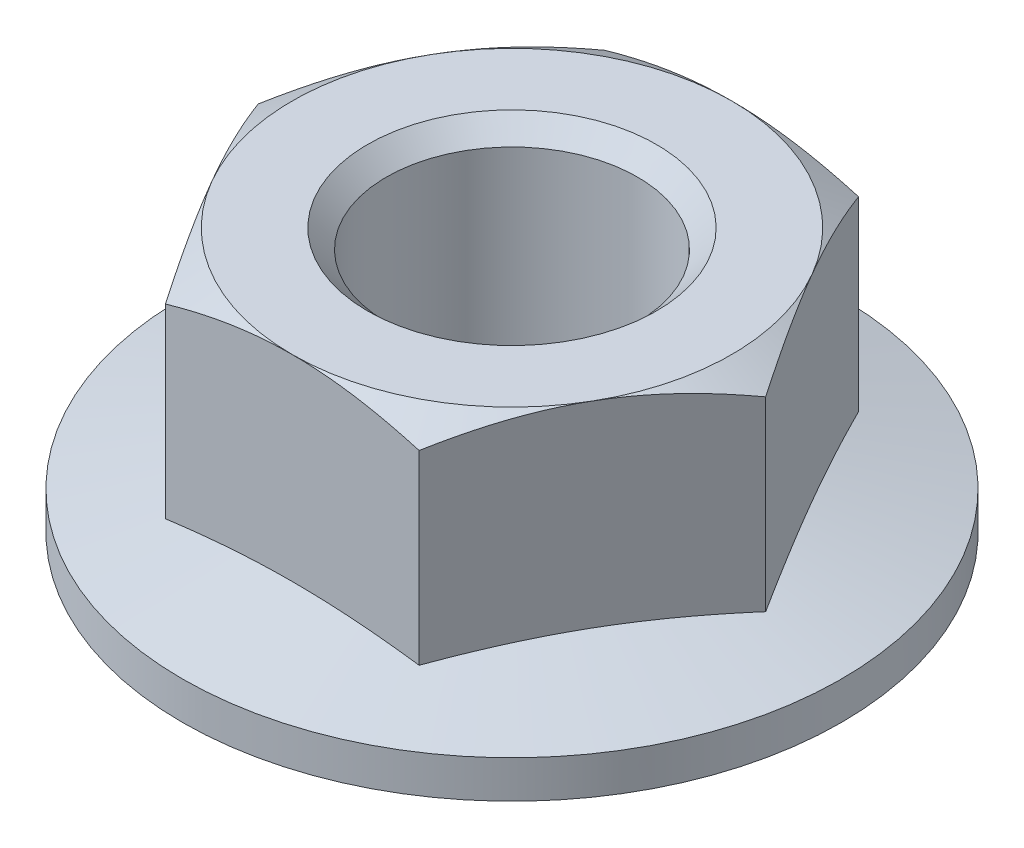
ISO-10303-21;
HEADER;
FILE_DESCRIPTION(('STEP AP214'),'2;1');
FILE_NAME('part.step','',(''),(''),'','','');
FILE_SCHEMA(('AUTOMOTIVE_DESIGN { 1 0 10303 214 1 1 1 1 }'));
ENDSEC;
DATA;
#1=APPLICATION_CONTEXT('core data for automotive mechanical design processes');
#2=APPLICATION_PROTOCOL_DEFINITION('international standard','automotive_design',2000,#1);
#3=PRODUCT_CONTEXT('',#1,'mechanical');
#4=PRODUCT('Part','Part','',(#3));
#5=PRODUCT_RELATED_PRODUCT_CATEGORY('part','',(#4));
#6=PRODUCT_DEFINITION_FORMATION('','',#4);
#7=PRODUCT_DEFINITION_CONTEXT('part definition',#1,'design');
#8=PRODUCT_DEFINITION('design','',#6,#7);
#9=PRODUCT_DEFINITION_SHAPE('','',#8);
#10=(LENGTH_UNIT() NAMED_UNIT(*) SI_UNIT(.MILLI.,.METRE.));
#11=(NAMED_UNIT(*) PLANE_ANGLE_UNIT() SI_UNIT($,.RADIAN.));
#12=(NAMED_UNIT(*) SI_UNIT($,.STERADIAN.) SOLID_ANGLE_UNIT());
#13=UNCERTAINTY_MEASURE_WITH_UNIT(LENGTH_MEASURE(1.E-05),#10,'distance_accuracy_value','');
#14=(GEOMETRIC_REPRESENTATION_CONTEXT(3) GLOBAL_UNCERTAINTY_ASSIGNED_CONTEXT((#13)) GLOBAL_UNIT_ASSIGNED_CONTEXT((#10,
#11,#12)) REPRESENTATION_CONTEXT('',''));
#15=CARTESIAN_POINT('',(0.,0.,0.));
#16=DIRECTION('',(0.,0.,1.));
#17=DIRECTION('',(1.,0.,0.));
#18=AXIS2_PLACEMENT_3D('',#15,#16,#17);
#19=CARTESIAN_POINT('',(1.1906925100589E-08,2.2208428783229,0.));
#20=DIRECTION('',(0.,-1.,0.));
#21=DIRECTION('',(0.,0.,-1.));
#22=AXIS2_PLACEMENT_3D('',#19,#20,#21);
#23=CONICAL_SURFACE('',#22,4.84974226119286,1.0471975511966);
#24=CARTESIAN_POINT('',(4.84988083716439,2.22076287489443,-0.000239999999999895));
#25=CARTESIAN_POINT('',(4.743320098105,2.28230880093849,0.18432861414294));
#26=CARTESIAN_POINT('',(4.6358395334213,2.33828260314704,0.370490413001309));
#27=CARTESIAN_POINT('',(4.41901725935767,2.43598549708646,0.746037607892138));
#28=CARTESIAN_POINT('',(4.30967169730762,2.477680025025,0.935429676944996));
#29=CARTESIAN_POINT('',(4.09233570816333,2.54258371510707,1.31186665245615));
#30=CARTESIAN_POINT('',(3.98437872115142,2.56622484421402,1.49885363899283));
#31=CARTESIAN_POINT('',(3.76795676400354,2.59444758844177,1.87370746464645));
#32=CARTESIAN_POINT('',(3.6594925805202,2.5990525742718,2.06157294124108));
#33=CARTESIAN_POINT('',(3.45682062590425,2.5894733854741,2.41261106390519));
#34=CARTESIAN_POINT('',(3.3625825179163,2.57764122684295,2.57583625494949));
#35=CARTESIAN_POINT('',(3.17472026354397,2.54013998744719,2.90122322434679));
#36=CARTESIAN_POINT('',(3.08109676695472,2.51445809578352,3.06338387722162));
#37=CARTESIAN_POINT('',(2.89284716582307,2.45025525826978,3.38944175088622));
#38=CARTESIAN_POINT('',(2.79824488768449,2.41146215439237,3.553297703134));
#39=CARTESIAN_POINT('',(2.61045131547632,2.32341702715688,3.8785657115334));
#40=CARTESIAN_POINT('',(2.51725761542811,2.27418569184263,4.03998193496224));
#41=CARTESIAN_POINT('',(2.42473257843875,2.22076287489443,4.20024));
#42=B_SPLINE_CURVE_WITH_KNOTS('',3,(#24,#25,#26,#27,#28,#29,#30,#31,#32,#33,#34,#35,#36,#37,#38,
#39,#40,#41),.UNSPECIFIED.,.F.,.F.,(4,2,2,2,2,2,2,2,4),(0.,0.665752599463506,1.33310548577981,
1.98394160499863,2.63397845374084,3.19998157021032,3.76650913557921,4.34560335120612,
4.92356038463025),.UNSPECIFIED.);
#43=CARTESIAN_POINT('',(4.84974227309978,2.2208428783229,0.));
#44=VERTEX_POINT('',#43);
#45=CARTESIAN_POINT('',(3.63730670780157,2.59597174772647,2.1));
#46=VERTEX_POINT('',#45);
#47=EDGE_CURVE('E304',#44,#46,#42,.T.);
#48=ORIENTED_EDGE('',*,*,#47,.F.);
#49=CARTESIAN_POINT('',(2.42473257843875,2.22076287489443,-4.20024));
#50=CARTESIAN_POINT('',(2.53129331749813,2.28230880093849,-4.01567138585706));
#51=CARTESIAN_POINT('',(2.63877388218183,2.33828260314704,-3.82950958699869));
#52=CARTESIAN_POINT('',(2.85559615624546,2.43598549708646,-3.45396239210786));
#53=CARTESIAN_POINT('',(2.96494171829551,2.477680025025,-3.264570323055));
#54=CARTESIAN_POINT('',(3.18227770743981,2.54258371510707,-2.88813334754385));
#55=CARTESIAN_POINT('',(3.29023469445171,2.56622484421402,-2.70114636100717));
#56=CARTESIAN_POINT('',(3.50665665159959,2.59444758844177,-2.32629253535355));
#57=CARTESIAN_POINT('',(3.61512083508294,2.5990525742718,-2.13842705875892));
#58=CARTESIAN_POINT('',(3.81779278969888,2.5894733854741,-1.78738893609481));
#59=CARTESIAN_POINT('',(3.91203089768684,2.57764122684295,-1.62416374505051));
#60=CARTESIAN_POINT('',(4.09989315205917,2.54013998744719,-1.29877677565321));
#61=CARTESIAN_POINT('',(4.19351664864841,2.51445809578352,-1.13661612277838));
#62=CARTESIAN_POINT('',(4.38176624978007,2.45025525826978,-0.810558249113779));
#63=CARTESIAN_POINT('',(4.47636852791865,2.41146215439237,-0.646702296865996));
#64=CARTESIAN_POINT('',(4.66416210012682,2.32341702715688,-0.321434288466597));
#65=CARTESIAN_POINT('',(4.75735580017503,2.27418569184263,-0.160018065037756));
#66=CARTESIAN_POINT('',(4.84988083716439,2.22076287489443,0.000240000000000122));
#67=B_SPLINE_CURVE_WITH_KNOTS('',3,(#49,#50,#51,#52,#53,#54,#55,#56,#57,#58,#59,#60,#61,#62,#63,
#64,#65,#66),.UNSPECIFIED.,.F.,.F.,(4,2,2,2,2,2,2,2,4),(0.,0.665752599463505,1.33310548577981,
1.98394160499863,2.63397845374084,3.19998157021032,3.76650913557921,4.34560335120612,
4.92356038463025),.UNSPECIFIED.);
#68=CARTESIAN_POINT('',(3.63730670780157,2.59597174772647,-2.1));
#69=VERTEX_POINT('',#68);
#70=EDGE_CURVE('E111',#69,#44,#67,.T.);
#71=ORIENTED_EDGE('',*,*,#70,.F.);
#72=CARTESIAN_POINT('',(1.1906925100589E-08,2.59597174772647,0.));
#73=DIRECTION('',(0.,1.,0.));
#74=DIRECTION('',(0.,0.,1.));
#75=AXIS2_PLACEMENT_3D('',#72,#73,#74);
#76=CIRCLE('',#75,4.2);
#77=EDGE_CURVE('E279',#46,#69,#76,.T.);
#78=ORIENTED_EDGE('',*,*,#77,.F.);
#79=EDGE_LOOP('',(#48,#71,#78));
#80=FACE_BOUND('',#79,.T.);
#81=ADVANCED_FACE('F40',(#80),#23,.T.);
#82=CARTESIAN_POINT('',(2.42487114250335,2.2208428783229,4.2));
#83=VERTEX_POINT('',#82);
#84=EDGE_CURVE('E225',#46,#83,#42,.T.);
#85=ORIENTED_EDGE('',*,*,#84,.F.);
#86=CARTESIAN_POINT('',(1.19069241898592E-08,2.59597174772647,4.2));
#87=VERTEX_POINT('',#86);
#88=EDGE_CURVE('E280',#87,#46,#76,.T.);
#89=ORIENTED_EDGE('',*,*,#88,.F.);
#90=CARTESIAN_POINT('',(7.28933992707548,0.163735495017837,4.2));
#91=CARTESIAN_POINT('',(7.11486696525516,0.251002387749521,4.2));
#92=CARTESIAN_POINT('',(6.94008948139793,0.337666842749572,4.2));
#93=CARTESIAN_POINT('',(6.58978667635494,0.509499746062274,4.2));
#94=CARTESIAN_POINT('',(6.41426130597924,0.59466809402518,4.2));
#95=CARTESIAN_POINT('',(6.06199245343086,0.763375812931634,4.2));
#96=CARTESIAN_POINT('',(5.88524722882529,0.846911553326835,4.2));
#97=CARTESIAN_POINT('',(5.53073100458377,1.01177234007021,4.2));
#98=CARTESIAN_POINT('',(5.35296002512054,1.09309742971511,4.2));
#99=CARTESIAN_POINT('',(4.98816803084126,1.25662493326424,4.2));
#100=CARTESIAN_POINT('',(4.80109071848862,1.33870217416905,4.2));
#101=CARTESIAN_POINT('',(4.4253413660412,1.49911775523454,4.2));
#102=CARTESIAN_POINT('',(4.23666938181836,1.57745622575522,4.2));
#103=CARTESIAN_POINT('',(3.85752408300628,1.72934602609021,4.2));
#104=CARTESIAN_POINT('',(3.66705188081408,1.8029001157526,4.2));
#105=CARTESIAN_POINT('',(3.28388177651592,1.9439338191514,4.2));
#106=CARTESIAN_POINT('',(3.09118412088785,2.01141409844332,4.2));
#107=CARTESIAN_POINT('',(2.65771925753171,2.15352486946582,4.2));
#108=CARTESIAN_POINT('',(2.41627512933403,2.22612196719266,4.2));
#109=CARTESIAN_POINT('',(1.92903367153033,2.3553529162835,4.2));
#110=CARTESIAN_POINT('',(1.68323673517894,2.41198820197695,4.2));
#111=CARTESIAN_POINT('',(1.31372733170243,2.4809882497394,4.2));
#112=CARTESIAN_POINT('',(1.19147091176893,2.50122237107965,4.2));
#113=CARTESIAN_POINT('',(0.946175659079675,2.53614748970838,4.2));
#114=CARTESIAN_POINT('',(0.823136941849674,2.55083928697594,4.2));
#115=CARTESIAN_POINT('',(0.57652320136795,2.57424030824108,4.2));
#116=CARTESIAN_POINT('',(0.452948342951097,2.58295125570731,4.2));
#117=CARTESIAN_POINT('',(0.205513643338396,2.59411488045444,4.2));
#118=CARTESIAN_POINT('',(0.0816538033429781,2.59656758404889,4.2));
#119=CARTESIAN_POINT('',(-0.166770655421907,2.59512695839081,4.2));
#120=CARTESIAN_POINT('',(-0.291335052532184,2.59119553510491,4.2));
#121=CARTESIAN_POINT('',(-0.540103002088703,2.57704895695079,4.2));
#122=CARTESIAN_POINT('',(-0.664306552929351,2.5668337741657,4.2));
#123=CARTESIAN_POINT('',(-0.912114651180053,2.54044543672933,4.2));
#124=CARTESIAN_POINT('',(-1.03571899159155,2.52427035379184,4.2));
#125=CARTESIAN_POINT('',(-1.28209244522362,2.48643637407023,4.2));
#126=CARTESIAN_POINT('',(-1.40486143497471,2.4647766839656,4.2));
#127=CARTESIAN_POINT('',(-1.77581159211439,2.39159054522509,4.2));
#128=CARTESIAN_POINT('',(-2.0224788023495,2.33233143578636,4.2));
#129=CARTESIAN_POINT('',(-2.51155018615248,2.19823166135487,4.2));
#130=CARTESIAN_POINT('',(-2.75395187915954,2.12338223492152,4.2));
#131=CARTESIAN_POINT('',(-3.18378906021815,1.97930803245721,4.2));
#132=CARTESIAN_POINT('',(-3.37196638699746,1.91226386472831,4.2));
#133=CARTESIAN_POINT('',(-3.74616762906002,1.77259269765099,4.2));
#134=CARTESIAN_POINT('',(-3.93219212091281,1.69996723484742,4.2));
#135=CARTESIAN_POINT('',(-4.30257983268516,1.55026630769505,4.2));
#136=CARTESIAN_POINT('',(-4.48694182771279,1.47318783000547,4.2));
#137=CARTESIAN_POINT('',(-4.85416725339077,1.31553716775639,4.2));
#138=CARTESIAN_POINT('',(-5.03703063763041,1.23496487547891,4.2));
#139=CARTESIAN_POINT('',(-5.39380024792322,1.07448943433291,4.2));
#140=CARTESIAN_POINT('',(-5.56775857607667,0.994701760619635,4.2));
#141=CARTESIAN_POINT('',(-5.91469657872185,0.833036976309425,4.2));
#142=CARTESIAN_POINT('',(-6.08767626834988,0.751159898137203,4.2));
#143=CARTESIAN_POINT('',(-6.43250489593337,0.585834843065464,4.2));
#144=CARTESIAN_POINT('',(-6.60435529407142,0.502389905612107,4.2));
#145=CARTESIAN_POINT('',(-6.94734786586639,0.334068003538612,4.2));
#146=CARTESIAN_POINT('',(-7.11849005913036,0.249191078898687,4.2));
#147=CARTESIAN_POINT('',(-7.28933990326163,0.163735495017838,4.2));
#148=B_SPLINE_CURVE_WITH_KNOTS('',3,(#90,#91,#92,#93,#94,#95,#96,#97,#98,#99,#100,#101,#102,
#103,#104,#105,#106,#107,#108,#109,#110,#111,#112,#113,#114,#115,#116,#117,#118,#119,#120,#121,
#122,#123,#124,#125,#126,#127,#128,#129,#130,#131,#132,#133,#134,#135,#136,#137,#138,#139,#140,
#141,#142,#143,#144,#145,#146,#147),.UNSPECIFIED.,.F.,.F.,(4,2,2,2,2,2,2,2,2,2,2,2,2,2,2,2,2,2,
2,2,2,2,2,2,2,2,2,2,4),(0.,0.58524400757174,1.1705271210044,1.75699027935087,2.34344194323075,
2.95628113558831,3.56909894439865,4.18156005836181,4.79395397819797,5.54993830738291,
6.30585468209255,6.67750740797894,7.04910646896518,7.4205984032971,7.79208877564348,
8.16580398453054,8.53952085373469,8.91335874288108,9.28725073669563,10.0475459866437,
10.8082696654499,11.4074579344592,12.0064818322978,12.6059159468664,13.2053685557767,
13.7795021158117,14.3536267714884,14.9267344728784,15.4998261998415),.UNSPECIFIED.);
#149=EDGE_CURVE('E224',#83,#87,#148,.T.);
#150=ORIENTED_EDGE('',*,*,#149,.F.);
#151=EDGE_LOOP('',(#85,#89,#150));
#152=FACE_BOUND('',#151,.T.);
#153=ADVANCED_FACE('F242',(#152),#23,.T.);
#154=CARTESIAN_POINT('',(-2.4248711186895,2.2208428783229,4.2));
#155=VERTEX_POINT('',#154);
#156=EDGE_CURVE('E218',#87,#155,#148,.T.);
#157=ORIENTED_EDGE('',*,*,#156,.F.);
#158=CARTESIAN_POINT('',(-3.63730668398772,2.59597174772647,2.1));
#159=VERTEX_POINT('',#158);
#160=EDGE_CURVE('E283',#159,#87,#76,.T.);
#161=ORIENTED_EDGE('',*,*,#160,.F.);
#162=CARTESIAN_POINT('',(-2.4247325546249,2.22076287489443,4.20024));
#163=CARTESIAN_POINT('',(-2.53129329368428,2.28230880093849,4.01567138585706));
#164=CARTESIAN_POINT('',(-2.63877385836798,2.33828260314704,3.82950958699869));
#165=CARTESIAN_POINT('',(-2.85559613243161,2.43598549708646,3.45396239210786));
#166=CARTESIAN_POINT('',(-2.96494169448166,2.477680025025,3.264570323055));
#167=CARTESIAN_POINT('',(-3.18227768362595,2.54258371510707,2.88813334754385));
#168=CARTESIAN_POINT('',(-3.29023467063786,2.56622484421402,2.70114636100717));
#169=CARTESIAN_POINT('',(-3.50665662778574,2.59444758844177,2.32629253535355));
#170=CARTESIAN_POINT('',(-3.61512081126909,2.5990525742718,2.13842705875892));
#171=CARTESIAN_POINT('',(-3.81779276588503,2.5894733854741,1.78738893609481));
#172=CARTESIAN_POINT('',(-3.91203087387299,2.57764122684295,1.62416374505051));
#173=CARTESIAN_POINT('',(-4.09989312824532,2.54013998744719,1.29877677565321));
#174=CARTESIAN_POINT('',(-4.19351662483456,2.51445809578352,1.13661612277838));
#175=CARTESIAN_POINT('',(-4.38176622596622,2.45025525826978,0.810558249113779));
#176=CARTESIAN_POINT('',(-4.4763685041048,2.41146215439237,0.646702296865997));
#177=CARTESIAN_POINT('',(-4.66416207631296,2.32341702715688,0.321434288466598));
#178=CARTESIAN_POINT('',(-4.75735577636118,2.27418569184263,0.160018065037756));
#179=CARTESIAN_POINT('',(-4.84988081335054,2.22076287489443,-0.000239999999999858));
#180=B_SPLINE_CURVE_WITH_KNOTS('',3,(#162,#163,#164,#165,#166,#167,#168,#169,#170,#171,#172,
#173,#174,#175,#176,#177,#178,#179),.UNSPECIFIED.,.F.,.F.,(4,2,2,2,2,2,2,2,4),(0.,
0.665752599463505,1.3331054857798,1.98394160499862,2.63397845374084,3.19998157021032,
3.76650913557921,4.34560335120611,4.92356038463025),.UNSPECIFIED.);
#181=EDGE_CURVE('E217',#155,#159,#180,.T.);
#182=ORIENTED_EDGE('',*,*,#181,.F.);
#183=EDGE_LOOP('',(#157,#161,#182));
#184=FACE_BOUND('',#183,.T.);
#185=ADVANCED_FACE('F248',(#184),#23,.T.);
#186=CARTESIAN_POINT('',(-4.84974224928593,2.2208428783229,0.));
#187=VERTEX_POINT('',#186);
#188=EDGE_CURVE('E211',#159,#187,#180,.T.);
#189=ORIENTED_EDGE('',*,*,#188,.F.);
#190=CARTESIAN_POINT('',(-3.63730668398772,2.59597174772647,-2.1));
#191=VERTEX_POINT('',#190);
#192=EDGE_CURVE('E275',#191,#159,#76,.T.);
#193=ORIENTED_EDGE('',*,*,#192,.F.);
#194=CARTESIAN_POINT('',(-4.84988081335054,2.22076287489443,0.000240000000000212));
#195=CARTESIAN_POINT('',(-4.74332007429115,2.28230880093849,-0.18432861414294));
#196=CARTESIAN_POINT('',(-4.63583950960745,2.33828260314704,-0.370490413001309));
#197=CARTESIAN_POINT('',(-4.41901723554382,2.43598549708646,-0.746037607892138));
#198=CARTESIAN_POINT('',(-4.30967167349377,2.477680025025,-0.935429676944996));
#199=CARTESIAN_POINT('',(-4.09233568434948,2.54258371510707,-1.31186665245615));
#200=CARTESIAN_POINT('',(-3.98437869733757,2.56622484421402,-1.49885363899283));
#201=CARTESIAN_POINT('',(-3.76795674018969,2.59444758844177,-1.87370746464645));
#202=CARTESIAN_POINT('',(-3.65949255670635,2.5990525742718,-2.06157294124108));
#203=CARTESIAN_POINT('',(-3.4568206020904,2.5894733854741,-2.41261106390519));
#204=CARTESIAN_POINT('',(-3.36258249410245,2.57764122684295,-2.57583625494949));
#205=CARTESIAN_POINT('',(-3.17472023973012,2.54013998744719,-2.9012232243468));
#206=CARTESIAN_POINT('',(-3.08109674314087,2.51445809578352,-3.06338387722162));
#207=CARTESIAN_POINT('',(-2.89284714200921,2.45025525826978,-3.38944175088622));
#208=CARTESIAN_POINT('',(-2.79824486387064,2.41146215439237,-3.553297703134));
#209=CARTESIAN_POINT('',(-2.61045129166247,2.32341702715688,-3.8785657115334));
#210=CARTESIAN_POINT('',(-2.51725759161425,2.27418569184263,-4.03998193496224));
#211=CARTESIAN_POINT('',(-2.4247325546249,2.22076287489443,-4.20024));
#212=B_SPLINE_CURVE_WITH_KNOTS('',3,(#194,#195,#196,#197,#198,#199,#200,#201,#202,#203,#204,
#205,#206,#207,#208,#209,#210,#211),.UNSPECIFIED.,.F.,.F.,(4,2,2,2,2,2,2,2,4),(0.,
0.665752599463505,1.33310548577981,1.98394160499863,2.63397845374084,3.19998157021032,
3.76650913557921,4.34560335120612,4.92356038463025),.UNSPECIFIED.);
#213=EDGE_CURVE('E203',#187,#191,#212,.T.);
#214=ORIENTED_EDGE('',*,*,#213,.F.);
#215=EDGE_LOOP('',(#189,#193,#214));
#216=FACE_BOUND('',#215,.T.);
#217=ADVANCED_FACE('F259',(#216),#23,.T.);
#218=CARTESIAN_POINT('',(-2.4248711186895,2.2208428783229,-4.2));
#219=VERTEX_POINT('',#218);
#220=EDGE_CURVE('E196',#191,#219,#212,.T.);
#221=ORIENTED_EDGE('',*,*,#220,.F.);
#222=CARTESIAN_POINT('',(1.19069252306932E-08,2.59597174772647,-4.2));
#223=VERTEX_POINT('',#222);
#224=EDGE_CURVE('E271',#223,#191,#76,.T.);
#225=ORIENTED_EDGE('',*,*,#224,.F.);
#226=CARTESIAN_POINT('',(-7.28933990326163,0.163735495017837,-4.2));
#227=CARTESIAN_POINT('',(-7.11486694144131,0.25100238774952,-4.2));
#228=CARTESIAN_POINT('',(-6.94008945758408,0.337666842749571,-4.2));
#229=CARTESIAN_POINT('',(-6.58978665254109,0.509499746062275,-4.2));
#230=CARTESIAN_POINT('',(-6.41426128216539,0.594668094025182,-4.2));
#231=CARTESIAN_POINT('',(-6.06199242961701,0.763375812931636,-4.2));
#232=CARTESIAN_POINT('',(-5.88524720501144,0.846911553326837,-4.2));
#233=CARTESIAN_POINT('',(-5.53073098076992,1.01177234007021,-4.2));
#234=CARTESIAN_POINT('',(-5.35296000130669,1.09309742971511,-4.2));
#235=CARTESIAN_POINT('',(-4.98816800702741,1.25662493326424,-4.2));
#236=CARTESIAN_POINT('',(-4.80109069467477,1.33870217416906,-4.2));
#237=CARTESIAN_POINT('',(-4.42534134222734,1.49911775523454,-4.2));
#238=CARTESIAN_POINT('',(-4.23666935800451,1.57745622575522,-4.2));
#239=CARTESIAN_POINT('',(-3.85752405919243,1.72934602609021,-4.2));
#240=CARTESIAN_POINT('',(-3.66705185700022,1.8029001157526,-4.2));
#241=CARTESIAN_POINT('',(-3.28388175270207,1.9439338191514,-4.2));
#242=CARTESIAN_POINT('',(-3.091184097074,2.01141409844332,-4.2));
#243=CARTESIAN_POINT('',(-2.65771923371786,2.15352486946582,-4.2));
#244=CARTESIAN_POINT('',(-2.41627510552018,2.22612196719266,-4.2));
#245=CARTESIAN_POINT('',(-1.92903364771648,2.35535291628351,-4.2));
#246=CARTESIAN_POINT('',(-1.68323671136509,2.41198820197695,-4.2));
#247=CARTESIAN_POINT('',(-1.31372730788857,2.4809882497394,-4.2));
#248=CARTESIAN_POINT('',(-1.19147088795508,2.50122237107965,-4.2));
#249=CARTESIAN_POINT('',(-0.946175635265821,2.53614748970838,-4.2));
#250=CARTESIAN_POINT('',(-0.82313691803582,2.55083928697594,-4.2));
#251=CARTESIAN_POINT('',(-0.576523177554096,2.57424030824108,-4.2));
#252=CARTESIAN_POINT('',(-0.452948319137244,2.58295125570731,-4.2));
#253=CARTESIAN_POINT('',(-0.205513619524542,2.59411488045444,-4.2));
#254=CARTESIAN_POINT('',(-0.0816537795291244,2.59656758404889,-4.2));
#255=CARTESIAN_POINT('',(0.166770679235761,2.59512695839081,-4.2));
#256=CARTESIAN_POINT('',(0.291335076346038,2.59119553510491,-4.2));
#257=CARTESIAN_POINT('',(0.540103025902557,2.57704895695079,-4.2));
#258=CARTESIAN_POINT('',(0.664306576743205,2.5668337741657,-4.2));
#259=CARTESIAN_POINT('',(0.912114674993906,2.54044543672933,-4.2));
#260=CARTESIAN_POINT('',(1.0357190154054,2.52427035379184,-4.2));
#261=CARTESIAN_POINT('',(1.28209246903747,2.48643637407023,-4.2));
#262=CARTESIAN_POINT('',(1.40486145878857,2.4647766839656,-4.2));
#263=CARTESIAN_POINT('',(1.77581161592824,2.39159054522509,-4.2));
#264=CARTESIAN_POINT('',(2.02247882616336,2.33233143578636,-4.2));
#265=CARTESIAN_POINT('',(2.51155020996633,2.19823166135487,-4.2));
#266=CARTESIAN_POINT('',(2.7539519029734,2.12338223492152,-4.2));
#267=CARTESIAN_POINT('',(3.18378908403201,1.97930803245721,-4.2));
#268=CARTESIAN_POINT('',(3.37196641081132,1.91226386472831,-4.2));
#269=CARTESIAN_POINT('',(3.74616765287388,1.77259269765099,-4.2));
#270=CARTESIAN_POINT('',(3.93219214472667,1.69996723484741,-4.2));
#271=CARTESIAN_POINT('',(4.30257985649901,1.55026630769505,-4.2));
#272=CARTESIAN_POINT('',(4.48694185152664,1.47318783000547,-4.2));
#273=CARTESIAN_POINT('',(4.85416727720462,1.31553716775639,-4.2));
#274=CARTESIAN_POINT('',(5.03703066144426,1.23496487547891,-4.2));
#275=CARTESIAN_POINT('',(5.39380027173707,1.07448943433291,-4.2));
#276=CARTESIAN_POINT('',(5.56775859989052,0.994701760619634,-4.2));
#277=CARTESIAN_POINT('',(5.9146966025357,0.833036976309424,-4.2));
#278=CARTESIAN_POINT('',(6.08767629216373,0.751159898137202,-4.2));
#279=CARTESIAN_POINT('',(6.43250491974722,0.585834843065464,-4.2));
#280=CARTESIAN_POINT('',(6.60435531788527,0.502389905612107,-4.2));
#281=CARTESIAN_POINT('',(6.94734788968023,0.334068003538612,-4.2));
#282=CARTESIAN_POINT('',(7.11849008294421,0.249191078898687,-4.2));
#283=CARTESIAN_POINT('',(7.28933992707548,0.163735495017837,-4.2));
#284=B_SPLINE_CURVE_WITH_KNOTS('',3,(#226,#227,#228,#229,#230,#231,#232,#233,#234,#235,#236,
#237,#238,#239,#240,#241,#242,#243,#244,#245,#246,#247,#248,#249,#250,#251,#252,#253,#254,#255,
#256,#257,#258,#259,#260,#261,#262,#263,#264,#265,#266,#267,#268,#269,#270,#271,#272,#273,#274,
#275,#276,#277,#278,#279,#280,#281,#282,#283),.UNSPECIFIED.,.F.,.F.,(4,2,2,2,2,2,2,2,2,2,2,2,2,
2,2,2,2,2,2,2,2,2,2,2,2,2,2,2,4),(0.,0.585244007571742,1.1705271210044,1.75699027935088,
2.34344194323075,2.95628113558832,3.56909894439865,4.18156005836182,4.79395397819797,
5.54993830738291,6.30585468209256,6.67750740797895,7.04910646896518,7.4205984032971,
7.79208877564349,8.16580398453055,8.5395208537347,8.91335874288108,9.28725073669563,
10.0475459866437,10.8082696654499,11.4074579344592,12.0064818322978,12.6059159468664,
13.2053685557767,13.7795021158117,14.3536267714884,14.9267344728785,15.4998261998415),.UNSPECIFIED.);
#285=EDGE_CURVE('E204',#219,#223,#284,.T.);
#286=ORIENTED_EDGE('',*,*,#285,.F.);
#287=EDGE_LOOP('',(#221,#225,#286));
#288=FACE_BOUND('',#287,.T.);
#289=ADVANCED_FACE('F251',(#288),#23,.T.);
#290=CARTESIAN_POINT('',(2.42487114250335,2.2208428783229,-4.2));
#291=VERTEX_POINT('',#290);
#292=EDGE_CURVE('E205',#223,#291,#284,.T.);
#293=ORIENTED_EDGE('',*,*,#292,.F.);
#294=EDGE_CURVE('E265',#69,#223,#76,.T.);
#295=ORIENTED_EDGE('',*,*,#294,.F.);
#296=EDGE_CURVE('E61',#291,#69,#67,.T.);
#297=ORIENTED_EDGE('',*,*,#296,.F.);
#298=EDGE_LOOP('',(#293,#295,#297));
#299=FACE_BOUND('',#298,.T.);
#300=ADVANCED_FACE('F244',(#299),#23,.T.);
#301=CARTESIAN_POINT('',(1.1906925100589E-08,2.59597174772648,0.));
#302=DIRECTION('',(0.,1.,0.));
#303=DIRECTION('',(0.,0.,1.));
#304=AXIS2_PLACEMENT_3D('',#301,#302,#303);
#305=CONICAL_SURFACE('',#304,2.76,0.785398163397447);
#306=CARTESIAN_POINT('',(1.1906925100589E-08,2.23597174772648,0.));
#307=DIRECTION('',(0.,1.,0.));
#308=DIRECTION('',(0.,0.,1.));
#309=AXIS2_PLACEMENT_3D('',#306,#307,#308);
#310=CIRCLE('',#309,2.4);
#311=CARTESIAN_POINT('',(1.1906925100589E-08,2.23597174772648,2.4));
#312=VERTEX_POINT('',#311);
#313=EDGE_CURVE('E11',#312,#312,#310,.T.);
#314=ORIENTED_EDGE('',*,*,#313,.F.);
#315=EDGE_LOOP('',(#314));
#316=FACE_BOUND('',#315,.T.);
#317=CARTESIAN_POINT('',(1.1906925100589E-08,2.59597174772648,0.));
#318=DIRECTION('',(0.,1.,0.));
#319=DIRECTION('',(0.,0.,1.));
#320=AXIS2_PLACEMENT_3D('',#317,#318,#319);
#321=CIRCLE('',#320,2.76);
#322=CARTESIAN_POINT('',(1.1906925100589E-08,2.59597174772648,2.76));
#323=VERTEX_POINT('',#322);
#324=EDGE_CURVE('E284',#323,#323,#321,.T.);
#325=ORIENTED_EDGE('',*,*,#324,.T.);
#326=EDGE_LOOP('',(#325));
#327=FACE_BOUND('',#326,.T.);
#328=ADVANCED_FACE('F42',(#316,#327),#305,.F.);
#329=CARTESIAN_POINT('',(1.1906925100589E-08,1.75597174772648,0.));
#330=DIRECTION('',(0.,1.,0.));
#331=DIRECTION('',(0.,0.,1.));
#332=AXIS2_PLACEMENT_3D('',#329,#330,#331);
#333=CYLINDRICAL_SURFACE('',#332,2.4);
#334=CARTESIAN_POINT('',(1.1906925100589E-08,-2.08402825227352,0.));
#335=DIRECTION('',(0.,1.,0.));
#336=DIRECTION('',(0.,0.,1.));
#337=AXIS2_PLACEMENT_3D('',#334,#335,#336);
#338=CIRCLE('',#337,2.4);
#339=CARTESIAN_POINT('',(1.1906925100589E-08,-2.08402825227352,2.4));
#340=VERTEX_POINT('',#339);
#341=EDGE_CURVE('E48',#340,#340,#338,.T.);
#342=ORIENTED_EDGE('',*,*,#341,.F.);
#343=EDGE_LOOP('',(#342));
#344=FACE_BOUND('',#343,.T.);
#345=ORIENTED_EDGE('',*,*,#313,.T.);
#346=EDGE_LOOP('',(#345));
#347=FACE_BOUND('',#346,.T.);
#348=ADVANCED_FACE('F257',(#344,#347),#333,.F.);
#349=CARTESIAN_POINT('',(1.1906925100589E-08,-2.08402825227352,0.));
#350=DIRECTION('',(0.,-1.,0.));
#351=DIRECTION('',(0.,0.,-1.));
#352=AXIS2_PLACEMENT_3D('',#349,#350,#351);
#353=CONICAL_SURFACE('',#352,2.4,0.785398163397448);
#354=CARTESIAN_POINT('',(1.1906925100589E-08,-2.44402825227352,0.));
#355=DIRECTION('',(0.,1.,0.));
#356=DIRECTION('',(0.,0.,1.));
#357=AXIS2_PLACEMENT_3D('',#354,#355,#356);
#358=CIRCLE('',#357,2.76);
#359=CARTESIAN_POINT('',(1.1906925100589E-08,-2.44402825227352,2.76));
#360=VERTEX_POINT('',#359);
#361=EDGE_CURVE('E290',#360,#360,#358,.T.);
#362=ORIENTED_EDGE('',*,*,#361,.F.);
#363=EDGE_LOOP('',(#362));
#364=FACE_BOUND('',#363,.T.);
#365=ORIENTED_EDGE('',*,*,#341,.T.);
#366=EDGE_LOOP('',(#365));
#367=FACE_BOUND('',#366,.T.);
#368=ADVANCED_FACE('F295',(#364,#367),#353,.F.);
#369=CARTESIAN_POINT('',(2.76000001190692,-2.44402825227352,0.));
#370=DIRECTION('',(0.,1.,0.));
#371=DIRECTION('',(0.,0.,1.));
#372=AXIS2_PLACEMENT_3D('',#369,#370,#371);
#373=PLANE('',#372);
#374=CARTESIAN_POINT('',(1.1906925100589E-08,-2.44402825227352,0.));
#375=DIRECTION('',(0.,1.,0.));
#376=DIRECTION('',(0.,0.,1.));
#377=AXIS2_PLACEMENT_3D('',#374,#375,#376);
#378=CIRCLE('',#377,6.3);
#379=CARTESIAN_POINT('',(1.1906925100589E-08,-2.44402825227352,6.3));
#380=VERTEX_POINT('',#379);
#381=EDGE_CURVE('E287',#380,#380,#378,.T.);
#382=ORIENTED_EDGE('',*,*,#381,.F.);
#383=EDGE_LOOP('',(#382));
#384=FACE_BOUND('',#383,.T.);
#385=ORIENTED_EDGE('',*,*,#361,.T.);
#386=EDGE_LOOP('',(#385));
#387=FACE_BOUND('',#386,.T.);
#388=ADVANCED_FACE('F398',(#384,#387),#373,.F.);
#389=CARTESIAN_POINT('',(1.1906925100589E-08,1.75597174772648,0.));
#390=DIRECTION('',(0.,1.,0.));
#391=DIRECTION('',(0.,0.,1.));
#392=AXIS2_PLACEMENT_3D('',#389,#390,#391);
#393=CYLINDRICAL_SURFACE('',#392,6.3);
#394=CARTESIAN_POINT('',(1.1906925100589E-08,-1.72402825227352,0.));
#395=DIRECTION('',(0.,1.,0.));
#396=DIRECTION('',(0.,0.,1.));
#397=AXIS2_PLACEMENT_3D('',#394,#395,#396);
#398=CIRCLE('',#397,6.3);
#399=CARTESIAN_POINT('',(1.1906925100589E-08,-1.72402825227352,6.3));
#400=VERTEX_POINT('',#399);
#401=EDGE_CURVE('E282',#400,#400,#398,.T.);
#402=ORIENTED_EDGE('',*,*,#401,.F.);
#403=EDGE_LOOP('',(#402));
#404=FACE_BOUND('',#403,.T.);
#405=ORIENTED_EDGE('',*,*,#381,.T.);
#406=EDGE_LOOP('',(#405));
#407=FACE_BOUND('',#406,.T.);
#408=ADVANCED_FACE('F152',(#404,#407),#393,.T.);
#409=CARTESIAN_POINT('',(1.1906925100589E-08,-1.72402825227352,0.));
#410=DIRECTION('',(0.,-1.,0.));
#411=DIRECTION('',(0.,0.,-1.));
#412=AXIS2_PLACEMENT_3D('',#409,#410,#411);
#413=CONICAL_SURFACE('',#412,6.3,1.30899693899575);
#414=CARTESIAN_POINT('',(-6.33555454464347,-2.07270154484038,-4.2));
#415=CARTESIAN_POINT('',(-6.14578611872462,-2.03033180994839,-4.2));
#416=CARTESIAN_POINT('',(-5.95589679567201,-1.98849399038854,-4.2));
#417=CARTESIAN_POINT('',(-5.57581690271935,-1.90616932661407,-4.2));
#418=CARTESIAN_POINT('',(-5.38562631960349,-1.86568254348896,-4.2));
#419=CARTESIAN_POINT('',(-5.00470834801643,-1.78631071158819,-4.2));
#420=CARTESIAN_POINT('',(-4.81398061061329,-1.74742733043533,-4.2));
#421=CARTESIAN_POINT('',(-4.4321226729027,-1.67169454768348,-4.2));
#422=CARTESIAN_POINT('',(-4.24099247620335,-1.63484512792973,-4.2));
#423=CARTESIAN_POINT('',(-3.86003557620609,-1.56399284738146,-4.2));
#424=CARTESIAN_POINT('',(-3.67021324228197,-1.52996673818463,-4.2));
#425=CARTESIAN_POINT('',(-3.29004670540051,-1.46497463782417,-4.2));
#426=CARTESIAN_POINT('',(-3.09970249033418,-1.43400871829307,-4.2));
#427=CARTESIAN_POINT('',(-2.5278395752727,-1.34675363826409,-4.2));
#428=CARTESIAN_POINT('',(-2.14540276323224,-1.29609018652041,-4.2));
#429=CARTESIAN_POINT('',(-1.56786545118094,-1.23623894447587,-4.2));
#430=CARTESIAN_POINT('',(-1.37360351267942,-1.21892833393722,-4.2));
#431=CARTESIAN_POINT('',(-0.984605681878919,-1.19075634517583,-4.2));
#432=CARTESIAN_POINT('',(-0.789869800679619,-1.1798948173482,-4.2));
#433=CARTESIAN_POINT('',(-0.40021678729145,-1.16525201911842,-4.2));
#434=CARTESIAN_POINT('',(-0.205299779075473,-1.16146750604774,-4.2));
#435=CARTESIAN_POINT('',(0.184539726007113,-1.16120926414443,-4.2));
#436=CARTESIAN_POINT('',(0.379462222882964,-1.16473554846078,-4.2));
#437=CARTESIAN_POINT('',(0.769942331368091,-1.17890779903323,-4.2));
#438=CARTESIAN_POINT('',(0.965498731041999,-1.18958649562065,-4.2));
#439=CARTESIAN_POINT('',(1.35614788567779,-1.21746922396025,-4.2));
#440=CARTESIAN_POINT('',(1.55124061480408,-1.23467361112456,-4.2));
#441=CARTESIAN_POINT('',(1.94096363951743,-1.27475806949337,-4.2));
#442=CARTESIAN_POINT('',(2.13559354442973,-1.2976418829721,-4.2));
#443=CARTESIAN_POINT('',(2.52422788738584,-1.34815660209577,-4.2));
#444=CARTESIAN_POINT('',(2.71823232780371,-1.37578748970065,-4.2));
#445=CARTESIAN_POINT('',(3.14008964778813,-1.44019050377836,-4.2));
#446=CARTESIAN_POINT('',(3.36782690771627,-1.47771443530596,-4.2));
#447=CARTESIAN_POINT('',(3.82257432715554,-1.55695245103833,-4.2));
#448=CARTESIAN_POINT('',(4.049584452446,-1.59866672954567,-4.2));
#449=CARTESIAN_POINT('',(4.50301948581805,-1.6853477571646,-4.2));
#450=CARTESIAN_POINT('',(4.72944428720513,-1.73031506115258,-4.2));
#451=CARTESIAN_POINT('',(5.18177807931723,-1.82278025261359,-4.2));
#452=CARTESIAN_POINT('',(5.40768706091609,-1.87027818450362,-4.2));
#453=CARTESIAN_POINT('',(6.08497149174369,-2.01575473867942,-4.2));
#454=CARTESIAN_POINT('',(6.53571293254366,-2.11667845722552,-4.2));
#455=CARTESIAN_POINT('',(7.43606429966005,-2.32345214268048,-4.2));
#456=CARTESIAN_POINT('',(7.88567419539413,-2.42930224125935,-4.2));
#457=CARTESIAN_POINT('',(8.55600802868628,-2.58970947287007,-4.2));
#458=CARTESIAN_POINT('',(8.7770311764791,-2.64302048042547,-4.2));
#459=CARTESIAN_POINT('',(9.21891260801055,-2.75030932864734,-4.2));
#460=CARTESIAN_POINT('',(9.43977089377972,-2.80428716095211,-4.2));
#461=CARTESIAN_POINT('',(10.1021585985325,-2.96705428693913,-4.2));
#462=CARTESIAN_POINT('',(10.5434841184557,-3.07667318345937,-4.2));
#463=CARTESIAN_POINT('',(11.4249849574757,-3.29729299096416,-4.2));
#464=CARTESIAN_POINT('',(11.8651609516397,-3.40829121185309,-4.2));
#465=CARTESIAN_POINT('',(12.7451932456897,-3.63146712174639,-4.2));
#466=CARTESIAN_POINT('',(13.1850495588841,-3.74364475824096,-4.2));
#467=CARTESIAN_POINT('',(13.6248021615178,-3.85622387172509,-4.2));
#468=B_SPLINE_CURVE_WITH_KNOTS('',3,(#414,#415,#416,#417,#418,#419,#420,#421,#422,#423,#424,
#425,#426,#427,#428,#429,#430,#431,#432,#433,#434,#435,#436,#437,#438,#439,#440,#441,#442,#443,
#444,#445,#446,#447,#448,#449,#450,#451,#452,#453,#454,#455,#456,#457,#458,#459,#460,#461,#462,
#463,#464,#465,#466,#467),.UNSPECIFIED.,.F.,.F.,(4,2,2,2,2,2,2,2,2,2,2,2,2,2,2,2,2,2,2,2,2,2,2,
2,2,2,4),(0.,0.583324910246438,1.16667616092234,1.75061956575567,2.33455775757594,
2.91307545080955,3.49160668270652,4.64840086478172,5.23340889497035,5.81840335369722,
6.40312970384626,6.98785710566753,7.57527874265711,8.16273237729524,8.75057412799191,
9.3384136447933,10.0307850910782,10.7231886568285,11.4157106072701,12.1082447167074,
13.4938983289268,14.8795889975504,15.5616728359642,16.2437481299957,17.6079503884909,
18.9698149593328,20.331619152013),.UNSPECIFIED.);
#469=CARTESIAN_POINT('',(2.42487114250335,-1.33543286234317,-4.2));
#470=VERTEX_POINT('',#469);
#471=CARTESIAN_POINT('',(-2.4248711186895,-1.33543286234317,-4.2));
#472=VERTEX_POINT('',#471);
#473=EDGE_CURVE('E124',#470,#472,#468,.F.);
#474=ORIENTED_EDGE('',*,*,#473,.F.);
#475=CARTESIAN_POINT('',(4.84988083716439,-1.33546999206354,0.000240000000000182));
#476=CARTESIAN_POINT('',(4.74917055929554,-1.30847223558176,-0.174195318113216));
#477=CARTESIAN_POINT('',(4.64827767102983,-1.28396264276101,-0.348946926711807));
#478=CARTESIAN_POINT('',(4.4461355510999,-1.2409014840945,-0.699067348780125));
#479=CARTESIAN_POINT('',(4.34488619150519,-1.22235233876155,-0.874436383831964));
#480=CARTESIAN_POINT('',(4.14264506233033,-1.19229505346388,-1.22472829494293));
#481=CARTESIAN_POINT('',(4.04165466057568,-1.1807510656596,-1.39964880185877));
#482=CARTESIAN_POINT('',(3.83954505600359,-1.16527174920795,-1.74971290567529));
#483=CARTESIAN_POINT('',(3.73842588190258,-1.16133494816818,-1.92485645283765));
#484=CARTESIAN_POINT('',(3.53618753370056,-1.16133494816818,-2.27514354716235));
#485=CARTESIAN_POINT('',(3.43506835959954,-1.16527174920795,-2.45028709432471));
#486=CARTESIAN_POINT('',(3.23295875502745,-1.1807510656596,-2.80035119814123));
#487=CARTESIAN_POINT('',(3.13196835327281,-1.19229505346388,-2.97527170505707));
#488=CARTESIAN_POINT('',(2.92972722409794,-1.22235233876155,-3.32556361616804));
#489=CARTESIAN_POINT('',(2.82847786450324,-1.2409014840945,-3.50093265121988));
#490=CARTESIAN_POINT('',(2.62633574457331,-1.28396264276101,-3.85105307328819));
#491=CARTESIAN_POINT('',(2.52544285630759,-1.30847223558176,-4.02580468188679));
#492=CARTESIAN_POINT('',(2.42473257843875,-1.33546999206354,-4.20024));
#493=B_SPLINE_CURVE_WITH_KNOTS('',3,(#475,#476,#477,#478,#479,#480,#481,#482,#483,#484,#485,
#486,#487,#488,#489,#490,#491,#492),.UNSPECIFIED.,.F.,.F.,(4,2,2,2,2,2,2,2,4),(0.,
0.6096974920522,1.21964226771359,1.82643882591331,2.4331179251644,3.0397970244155,
3.64659358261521,4.25653835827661,4.86623585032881),.UNSPECIFIED.);
#494=CARTESIAN_POINT('',(4.84974227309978,-1.33543286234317,0.));
#495=VERTEX_POINT('',#494);
#496=EDGE_CURVE('E55',#495,#470,#493,.T.);
#497=ORIENTED_EDGE('',*,*,#496,.F.);
#498=CARTESIAN_POINT('',(2.42473257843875,-1.33546999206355,4.20024));
#499=CARTESIAN_POINT('',(2.52544285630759,-1.30847223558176,4.02580468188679));
#500=CARTESIAN_POINT('',(2.62633574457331,-1.28396264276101,3.85105307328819));
#501=CARTESIAN_POINT('',(2.82847786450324,-1.2409014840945,3.50093265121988));
#502=CARTESIAN_POINT('',(2.92972722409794,-1.22235233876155,3.32556361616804));
#503=CARTESIAN_POINT('',(3.13196835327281,-1.19229505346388,2.97527170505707));
#504=CARTESIAN_POINT('',(3.23295875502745,-1.1807510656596,2.80035119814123));
#505=CARTESIAN_POINT('',(3.43506835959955,-1.16527174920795,2.45028709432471));
#506=CARTESIAN_POINT('',(3.53618753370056,-1.16133494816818,2.27514354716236));
#507=CARTESIAN_POINT('',(3.73842588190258,-1.16133494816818,1.92485645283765));
#508=CARTESIAN_POINT('',(3.83954505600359,-1.16527174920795,1.74971290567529));
#509=CARTESIAN_POINT('',(4.04165466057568,-1.1807510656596,1.39964880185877));
#510=CARTESIAN_POINT('',(4.14264506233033,-1.19229505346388,1.22472829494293));
#511=CARTESIAN_POINT('',(4.34488619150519,-1.22235233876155,0.874436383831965));
#512=CARTESIAN_POINT('',(4.4461355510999,-1.2409014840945,0.699067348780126));
#513=CARTESIAN_POINT('',(4.64827767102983,-1.28396264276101,0.348946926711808));
#514=CARTESIAN_POINT('',(4.74917055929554,-1.30847223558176,0.174195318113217));
#515=CARTESIAN_POINT('',(4.84988083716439,-1.33546999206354,-0.000239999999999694));
#516=B_SPLINE_CURVE_WITH_KNOTS('',3,(#498,#499,#500,#501,#502,#503,#504,#505,#506,#507,#508,
#509,#510,#511,#512,#513,#514,#515),.UNSPECIFIED.,.F.,.F.,(4,2,2,2,2,2,2,2,4),(0.,
0.609697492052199,1.21964226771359,1.82643882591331,2.4331179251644,3.0397970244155,
3.64659358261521,4.25653835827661,4.86623585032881),.UNSPECIFIED.);
#517=CARTESIAN_POINT('',(2.42487114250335,-1.33543286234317,4.2));
#518=VERTEX_POINT('',#517);
#519=EDGE_CURVE('E121',#518,#495,#516,.T.);
#520=ORIENTED_EDGE('',*,*,#519,.F.);
#521=CARTESIAN_POINT('',(-6.33555454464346,-2.07270154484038,4.2));
#522=CARTESIAN_POINT('',(-6.14578611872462,-2.03033180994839,4.2));
#523=CARTESIAN_POINT('',(-5.955896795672,-1.98849399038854,4.2));
#524=CARTESIAN_POINT('',(-5.57581690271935,-1.90616932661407,4.2));
#525=CARTESIAN_POINT('',(-5.38562631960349,-1.86568254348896,4.2));
#526=CARTESIAN_POINT('',(-5.00470834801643,-1.78631071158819,4.2));
#527=CARTESIAN_POINT('',(-4.81398061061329,-1.74742733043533,4.2));
#528=CARTESIAN_POINT('',(-4.4321226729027,-1.67169454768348,4.2));
#529=CARTESIAN_POINT('',(-4.24099247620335,-1.63484512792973,4.2));
#530=CARTESIAN_POINT('',(-3.86003557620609,-1.56399284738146,4.2));
#531=CARTESIAN_POINT('',(-3.67021324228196,-1.52996673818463,4.2));
#532=CARTESIAN_POINT('',(-3.29004670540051,-1.46497463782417,4.2));
#533=CARTESIAN_POINT('',(-3.09970249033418,-1.43400871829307,4.2));
#534=CARTESIAN_POINT('',(-2.52783957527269,-1.34675363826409,4.2));
#535=CARTESIAN_POINT('',(-2.14540276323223,-1.29609018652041,4.2));
#536=CARTESIAN_POINT('',(-1.56786545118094,-1.23623894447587,4.2));
#537=CARTESIAN_POINT('',(-1.37360351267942,-1.21892833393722,4.2));
#538=CARTESIAN_POINT('',(-0.984605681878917,-1.19075634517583,4.2));
#539=CARTESIAN_POINT('',(-0.789869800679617,-1.1798948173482,4.2));
#540=CARTESIAN_POINT('',(-0.400216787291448,-1.16525201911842,4.2));
#541=CARTESIAN_POINT('',(-0.205299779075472,-1.16146750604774,4.2));
#542=CARTESIAN_POINT('',(0.184539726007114,-1.16120926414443,4.2));
#543=CARTESIAN_POINT('',(0.379462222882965,-1.16473554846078,4.2));
#544=CARTESIAN_POINT('',(0.769942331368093,-1.17890779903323,4.2));
#545=CARTESIAN_POINT('',(0.965498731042,-1.18958649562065,4.2));
#546=CARTESIAN_POINT('',(1.35614788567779,-1.21746922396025,4.2));
#547=CARTESIAN_POINT('',(1.55124061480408,-1.23467361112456,4.2));
#548=CARTESIAN_POINT('',(1.94096363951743,-1.27475806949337,4.2));
#549=CARTESIAN_POINT('',(2.13559354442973,-1.2976418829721,4.2));
#550=CARTESIAN_POINT('',(2.52422788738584,-1.34815660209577,4.2));
#551=CARTESIAN_POINT('',(2.71823232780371,-1.37578748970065,4.2));
#552=CARTESIAN_POINT('',(3.14008964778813,-1.44019050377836,4.2));
#553=CARTESIAN_POINT('',(3.36782690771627,-1.47771443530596,4.2));
#554=CARTESIAN_POINT('',(3.82257432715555,-1.55695245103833,4.2));
#555=CARTESIAN_POINT('',(4.049584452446,-1.59866672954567,4.2));
#556=CARTESIAN_POINT('',(4.50301948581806,-1.6853477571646,4.2));
#557=CARTESIAN_POINT('',(4.72944428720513,-1.73031506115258,4.2));
#558=CARTESIAN_POINT('',(5.18177807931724,-1.82278025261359,4.2));
#559=CARTESIAN_POINT('',(5.40768706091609,-1.87027818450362,4.2));
#560=CARTESIAN_POINT('',(6.0849714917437,-2.01575473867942,4.2));
#561=CARTESIAN_POINT('',(6.53571293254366,-2.11667845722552,4.2));
#562=CARTESIAN_POINT('',(7.43606429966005,-2.32345214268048,4.2));
#563=CARTESIAN_POINT('',(7.88567419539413,-2.42930224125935,4.2));
#564=CARTESIAN_POINT('',(8.55600802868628,-2.58970947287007,4.2));
#565=CARTESIAN_POINT('',(8.7770311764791,-2.64302048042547,4.2));
#566=CARTESIAN_POINT('',(9.21891260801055,-2.75030932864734,4.2));
#567=CARTESIAN_POINT('',(9.43977089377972,-2.80428716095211,4.2));
#568=CARTESIAN_POINT('',(10.1021585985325,-2.96705428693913,4.2));
#569=CARTESIAN_POINT('',(10.5434841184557,-3.07667318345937,4.2));
#570=CARTESIAN_POINT('',(11.4249849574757,-3.29729299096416,4.2));
#571=CARTESIAN_POINT('',(11.8651609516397,-3.40829121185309,4.2));
#572=CARTESIAN_POINT('',(12.7451932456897,-3.63146712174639,4.2));
#573=CARTESIAN_POINT('',(13.1850495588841,-3.74364475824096,4.2));
#574=CARTESIAN_POINT('',(13.6248021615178,-3.85622387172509,4.2));
#575=B_SPLINE_CURVE_WITH_KNOTS('',3,(#521,#522,#523,#524,#525,#526,#527,#528,#529,#530,#531,
#532,#533,#534,#535,#536,#537,#538,#539,#540,#541,#542,#543,#544,#545,#546,#547,#548,#549,#550,
#551,#552,#553,#554,#555,#556,#557,#558,#559,#560,#561,#562,#563,#564,#565,#566,#567,#568,#569,
#570,#571,#572,#573,#574),.UNSPECIFIED.,.F.,.F.,(4,2,2,2,2,2,2,2,2,2,2,2,2,2,2,2,2,2,2,2,2,2,2,
2,2,2,4),(0.,0.583324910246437,1.16667616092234,1.75061956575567,2.33455775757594,
2.91307545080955,3.49160668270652,4.64840086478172,5.23340889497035,5.81840335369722,
6.40312970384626,6.98785710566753,7.57527874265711,8.16273237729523,8.7505741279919,
9.3384136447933,10.0307850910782,10.7231886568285,11.4157106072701,12.1082447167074,
13.4938983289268,14.8795889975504,15.5616728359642,16.2437481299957,17.6079503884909,
18.9698149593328,20.331619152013),.UNSPECIFIED.);
#576=CARTESIAN_POINT('',(-2.4248711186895,-1.33543286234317,4.2));
#577=VERTEX_POINT('',#576);
#578=EDGE_CURVE('E115',#577,#518,#575,.T.);
#579=ORIENTED_EDGE('',*,*,#578,.F.);
#580=CARTESIAN_POINT('',(-4.84988081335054,-1.33546999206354,-0.000239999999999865));
#581=CARTESIAN_POINT('',(-4.74917053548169,-1.30847223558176,0.174195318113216));
#582=CARTESIAN_POINT('',(-4.64827764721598,-1.28396264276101,0.348946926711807));
#583=CARTESIAN_POINT('',(-4.44613552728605,-1.2409014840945,0.699067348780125));
#584=CARTESIAN_POINT('',(-4.34488616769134,-1.22235233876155,0.874436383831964));
#585=CARTESIAN_POINT('',(-4.14264503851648,-1.19229505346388,1.22472829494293));
#586=CARTESIAN_POINT('',(-4.04165463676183,-1.1807510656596,1.39964880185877));
#587=CARTESIAN_POINT('',(-3.83954503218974,-1.16527174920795,1.74971290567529));
#588=CARTESIAN_POINT('',(-3.73842585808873,-1.16133494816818,1.92485645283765));
#589=CARTESIAN_POINT('',(-3.5361875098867,-1.16133494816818,2.27514354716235));
#590=CARTESIAN_POINT('',(-3.43506833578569,-1.16527174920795,2.45028709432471));
#591=CARTESIAN_POINT('',(-3.2329587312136,-1.1807510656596,2.80035119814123));
#592=CARTESIAN_POINT('',(-3.13196832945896,-1.19229505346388,2.97527170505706));
#593=CARTESIAN_POINT('',(-2.92972720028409,-1.22235233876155,3.32556361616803));
#594=CARTESIAN_POINT('',(-2.82847784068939,-1.2409014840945,3.50093265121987));
#595=CARTESIAN_POINT('',(-2.62633572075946,-1.28396264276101,3.85105307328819));
#596=CARTESIAN_POINT('',(-2.52544283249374,-1.30847223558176,4.02580468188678));
#597=CARTESIAN_POINT('',(-2.4247325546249,-1.33546999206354,4.20024));
#598=B_SPLINE_CURVE_WITH_KNOTS('',3,(#580,#581,#582,#583,#584,#585,#586,#587,#588,#589,#590,
#591,#592,#593,#594,#595,#596,#597),.UNSPECIFIED.,.F.,.F.,(4,2,2,2,2,2,2,2,4),(0.,
0.6096974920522,1.21964226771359,1.82643882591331,2.4331179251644,3.0397970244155,
3.64659358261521,4.25653835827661,4.86623585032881),.UNSPECIFIED.);
#599=CARTESIAN_POINT('',(-4.84974224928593,-1.33543286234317,0.));
#600=VERTEX_POINT('',#599);
#601=EDGE_CURVE('E167',#600,#577,#598,.T.);
#602=ORIENTED_EDGE('',*,*,#601,.F.);
#603=CARTESIAN_POINT('',(-2.4247325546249,-1.33546999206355,-4.20024));
#604=CARTESIAN_POINT('',(-2.52544283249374,-1.30847223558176,-4.02580468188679));
#605=CARTESIAN_POINT('',(-2.62633572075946,-1.28396264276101,-3.85105307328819));
#606=CARTESIAN_POINT('',(-2.82847784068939,-1.2409014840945,-3.50093265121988));
#607=CARTESIAN_POINT('',(-2.92972720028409,-1.22235233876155,-3.32556361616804));
#608=CARTESIAN_POINT('',(-3.13196832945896,-1.19229505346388,-2.97527170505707));
#609=CARTESIAN_POINT('',(-3.2329587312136,-1.1807510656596,-2.80035119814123));
#610=CARTESIAN_POINT('',(-3.43506833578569,-1.16527174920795,-2.45028709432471));
#611=CARTESIAN_POINT('',(-3.53618750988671,-1.16133494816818,-2.27514354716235));
#612=CARTESIAN_POINT('',(-3.73842585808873,-1.16133494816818,-1.92485645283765));
#613=CARTESIAN_POINT('',(-3.83954503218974,-1.16527174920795,-1.74971290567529));
#614=CARTESIAN_POINT('',(-4.04165463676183,-1.1807510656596,-1.39964880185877));
#615=CARTESIAN_POINT('',(-4.14264503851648,-1.19229505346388,-1.22472829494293));
#616=CARTESIAN_POINT('',(-4.34488616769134,-1.22235233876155,-0.874436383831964));
#617=CARTESIAN_POINT('',(-4.44613552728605,-1.2409014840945,-0.699067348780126));
#618=CARTESIAN_POINT('',(-4.64827764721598,-1.28396264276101,-0.348946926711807));
#619=CARTESIAN_POINT('',(-4.74917053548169,-1.30847223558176,-0.174195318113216));
#620=CARTESIAN_POINT('',(-4.84988081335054,-1.33546999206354,0.000240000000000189));
#621=B_SPLINE_CURVE_WITH_KNOTS('',3,(#603,#604,#605,#606,#607,#608,#609,#610,#611,#612,#613,
#614,#615,#616,#617,#618,#619,#620),.UNSPECIFIED.,.F.,.F.,(4,2,2,2,2,2,2,2,4),(0.,
0.6096974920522,1.21964226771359,1.82643882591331,2.4331179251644,3.0397970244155,
3.64659358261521,4.25653835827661,4.86623585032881),.UNSPECIFIED.);
#622=EDGE_CURVE('E174',#472,#600,#621,.T.);
#623=ORIENTED_EDGE('',*,*,#622,.F.);
#624=EDGE_LOOP('',(#474,#497,#520,#579,#602,#623));
#625=FACE_BOUND('',#624,.T.);
#626=ORIENTED_EDGE('',*,*,#401,.T.);
#627=EDGE_LOOP('',(#626));
#628=FACE_BOUND('',#627,.T.);
#629=ADVANCED_FACE('F119',(#625,#628),#413,.T.);
#630=CARTESIAN_POINT('',(4.20000001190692,2.59597174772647,0.));
#631=DIRECTION('',(0.,-1.,0.));
#632=DIRECTION('',(0.,0.,-1.));
#633=AXIS2_PLACEMENT_3D('',#630,#631,#632);
#634=PLANE('',#633);
#635=ORIENTED_EDGE('',*,*,#324,.F.);
#636=EDGE_LOOP('',(#635));
#637=FACE_BOUND('',#636,.T.);
#638=ORIENTED_EDGE('',*,*,#88,.T.);
#639=ORIENTED_EDGE('',*,*,#77,.T.);
#640=ORIENTED_EDGE('',*,*,#294,.T.);
#641=ORIENTED_EDGE('',*,*,#224,.T.);
#642=ORIENTED_EDGE('',*,*,#192,.T.);
#643=ORIENTED_EDGE('',*,*,#160,.T.);
#644=EDGE_LOOP('',(#638,#639,#640,#641,#642,#643));
#645=FACE_BOUND('',#644,.T.);
#646=ADVANCED_FACE('F151',(#637,#645),#634,.F.);
#647=CARTESIAN_POINT('',(2.42487114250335,-2.78314669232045,4.2));
#648=DIRECTION('',(0.866025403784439,0.,0.5));
#649=DIRECTION('',(0.5,0.,-0.866025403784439));
#650=AXIS2_PLACEMENT_3D('',#647,#648,#649);
#651=PLANE('',#650);
#652=ORIENTED_EDGE('',*,*,#47,.T.);
#653=ORIENTED_EDGE('',*,*,#84,.T.);
#654=DIRECTION('',(0.,1.,0.));
#655=VECTOR('',#654,1.);
#656=CARTESIAN_POINT('',(2.42487114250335,-2.78314669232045,4.2));
#657=LINE('',#656,#655);
#658=EDGE_CURVE('E129',#518,#83,#657,.T.);
#659=ORIENTED_EDGE('',*,*,#658,.F.);
#660=ORIENTED_EDGE('',*,*,#519,.T.);
#661=DIRECTION('',(0.,1.,0.));
#662=VECTOR('',#661,1.);
#663=CARTESIAN_POINT('',(4.84974227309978,-2.78314669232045,0.));
#664=LINE('',#663,#662);
#665=EDGE_CURVE('E109',#495,#44,#664,.T.);
#666=ORIENTED_EDGE('',*,*,#665,.T.);
#667=EDGE_LOOP('',(#652,#653,#659,#660,#666));
#668=FACE_BOUND('',#667,.T.);
#669=ADVANCED_FACE('F127',(#668),#651,.T.);
#670=CARTESIAN_POINT('',(-2.4248711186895,-2.78314669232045,4.2));
#671=DIRECTION('',(0.,0.,1.));
#672=DIRECTION('',(1.,0.,0.));
#673=AXIS2_PLACEMENT_3D('',#670,#671,#672);
#674=PLANE('',#673);
#675=ORIENTED_EDGE('',*,*,#149,.T.);
#676=ORIENTED_EDGE('',*,*,#156,.T.);
#677=DIRECTION('',(0.,1.,0.));
#678=VECTOR('',#677,1.);
#679=CARTESIAN_POINT('',(-2.4248711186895,-2.78314669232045,4.2));
#680=LINE('',#679,#678);
#681=EDGE_CURVE('E335',#577,#155,#680,.T.);
#682=ORIENTED_EDGE('',*,*,#681,.F.);
#683=ORIENTED_EDGE('',*,*,#578,.T.);
#684=ORIENTED_EDGE('',*,*,#658,.T.);
#685=EDGE_LOOP('',(#675,#676,#682,#683,#684));
#686=FACE_BOUND('',#685,.T.);
#687=ADVANCED_FACE('F231',(#686),#674,.T.);
#688=CARTESIAN_POINT('',(-4.84974224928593,-2.78314669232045,0.));
#689=DIRECTION('',(-0.866025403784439,0.,0.5));
#690=DIRECTION('',(0.5,0.,0.866025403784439));
#691=AXIS2_PLACEMENT_3D('',#688,#689,#690);
#692=PLANE('',#691);
#693=ORIENTED_EDGE('',*,*,#181,.T.);
#694=ORIENTED_EDGE('',*,*,#188,.T.);
#695=DIRECTION('',(0.,1.,0.));
#696=VECTOR('',#695,1.);
#697=CARTESIAN_POINT('',(-4.84974224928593,-2.78314669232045,0.));
#698=LINE('',#697,#696);
#699=EDGE_CURVE('E332',#600,#187,#698,.T.);
#700=ORIENTED_EDGE('',*,*,#699,.F.);
#701=ORIENTED_EDGE('',*,*,#601,.T.);
#702=ORIENTED_EDGE('',*,*,#681,.T.);
#703=EDGE_LOOP('',(#693,#694,#700,#701,#702));
#704=FACE_BOUND('',#703,.T.);
#705=ADVANCED_FACE('F190',(#704),#692,.T.);
#706=CARTESIAN_POINT('',(-2.4248711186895,-2.78314669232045,-4.2));
#707=DIRECTION('',(-0.866025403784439,0.,-0.5));
#708=DIRECTION('',(-0.5,0.,0.866025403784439));
#709=AXIS2_PLACEMENT_3D('',#706,#707,#708);
#710=PLANE('',#709);
#711=ORIENTED_EDGE('',*,*,#213,.T.);
#712=ORIENTED_EDGE('',*,*,#220,.T.);
#713=DIRECTION('',(0.,1.,0.));
#714=VECTOR('',#713,1.);
#715=CARTESIAN_POINT('',(-2.4248711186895,-2.78314669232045,-4.2));
#716=LINE('',#715,#714);
#717=EDGE_CURVE('E331',#472,#219,#716,.T.);
#718=ORIENTED_EDGE('',*,*,#717,.F.);
#719=ORIENTED_EDGE('',*,*,#622,.T.);
#720=ORIENTED_EDGE('',*,*,#699,.T.);
#721=EDGE_LOOP('',(#711,#712,#718,#719,#720));
#722=FACE_BOUND('',#721,.T.);
#723=ADVANCED_FACE('F186',(#722),#710,.T.);
#724=CARTESIAN_POINT('',(2.42487114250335,-2.78314669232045,-4.2));
#725=DIRECTION('',(0.,0.,-1.));
#726=DIRECTION('',(-1.,0.,0.));
#727=AXIS2_PLACEMENT_3D('',#724,#725,#726);
#728=PLANE('',#727);
#729=ORIENTED_EDGE('',*,*,#285,.T.);
#730=ORIENTED_EDGE('',*,*,#292,.T.);
#731=DIRECTION('',(0.,1.,0.));
#732=VECTOR('',#731,1.);
#733=CARTESIAN_POINT('',(2.42487114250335,-2.78314669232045,-4.2));
#734=LINE('',#733,#732);
#735=EDGE_CURVE('E116',#470,#291,#734,.T.);
#736=ORIENTED_EDGE('',*,*,#735,.F.);
#737=ORIENTED_EDGE('',*,*,#473,.T.);
#738=ORIENTED_EDGE('',*,*,#717,.T.);
#739=EDGE_LOOP('',(#729,#730,#736,#737,#738));
#740=FACE_BOUND('',#739,.T.);
#741=ADVANCED_FACE('F189',(#740),#728,.T.);
#742=CARTESIAN_POINT('',(4.84974227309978,-2.78314669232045,0.));
#743=DIRECTION('',(0.866025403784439,0.,-0.5));
#744=DIRECTION('',(-0.5,0.,-0.866025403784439));
#745=AXIS2_PLACEMENT_3D('',#742,#743,#744);
#746=PLANE('',#745);
#747=ORIENTED_EDGE('',*,*,#296,.T.);
#748=ORIENTED_EDGE('',*,*,#70,.T.);
#749=ORIENTED_EDGE('',*,*,#665,.F.);
#750=ORIENTED_EDGE('',*,*,#496,.T.);
#751=ORIENTED_EDGE('',*,*,#735,.T.);
#752=EDGE_LOOP('',(#747,#748,#749,#750,#751));
#753=FACE_BOUND('',#752,.T.);
#754=ADVANCED_FACE('F110',(#753),#746,.T.);
#755=CLOSED_SHELL('',(#81,#153,#185,#217,#289,#300,#328,#348,#368,#388,#408,#629,#646,#669,#687,
#705,#723,#741,#754));
#756=MANIFOLD_SOLID_BREP('B2',#755);
#757=ADVANCED_BREP_SHAPE_REPRESENTATION('',(#18,#756),#14);
#758=SHAPE_DEFINITION_REPRESENTATION(#9,#757);
ENDSEC;
END-ISO-10303-21;
